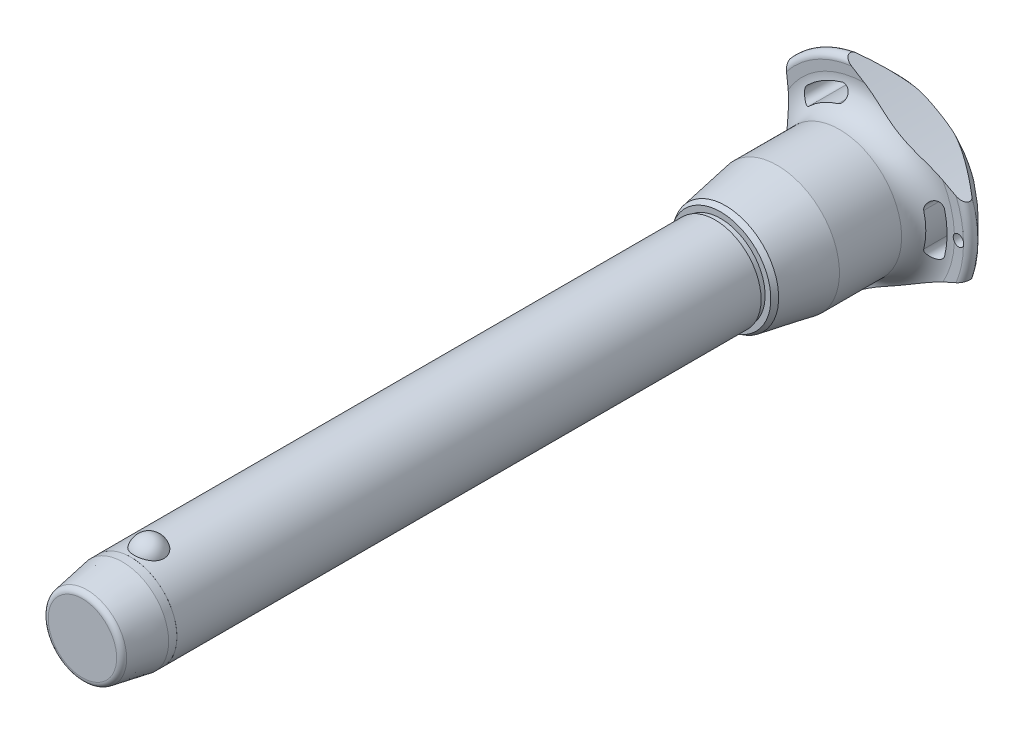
from build123d import *

# Parameters (mm, degrees)
SKETCH1_R           = 12.5
BOSS_EXTRUDE1_DEPTH = 150
SKETCH2_R           = 10
BOSS_EXTRUDE2_DEPTH = 50.7
BOSS_EXTRUDE3_START = 22
SKETCH1_2_R         = 12.5
BOSS_EXTRUDE3_DEPTH = 22
CHAMFER1_SIZE       = 11
CHAMFER1_SIZE2      = 1.939596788
FILLET1_R           = 1.5
SKETCH6_R           = 176.92625
CUT_EXTRUDE1_DEPTH  = 205.721493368
CIRPATTERN1_COUNT   = 3
SKETCH7_R           = 1.5
CUT_EXTRUDE2_DEPTH  = 205.647121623
SKETCH8_R           = 12.5
SKETCH8_R_2         = 12.49
CUT_EXTRUDE3_DEPTH  = 13.2


with BuildPart() as part:
    # Sketch1 → Boss-Extrude1 (new body)
    with BuildSketch(Plane.XY):
        Circle(SKETCH1_R)
    extrude(amount=-BOSS_EXTRUDE1_DEPTH)

    # Sketch2 → Boss-Extrude2 (add)
    with BuildSketch(Plane(origin=(0, 0, -150), x_dir=(-1, 0, 0), z_dir=(0, 0, -1))):
        with Locations(Location((0, 0, 0), (0, 0, 180))):
            Circle(SKETCH2_R)
    extrude(amount=BOSS_EXTRUDE2_DEPTH)

    # Sketch3 → Revolve1 (revolve)
    with BuildSketch(Plane(origin=(0, 0, 0), x_dir=(0, 0, -1), z_dir=(1, 0, 0))):
        with BuildLine():
            Line((-3.957271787, 15.4), (-3.957271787, 7.1))
            ThreePointArc((-3.957271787, 7.1), (0.192728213, 11.25), (-3.957271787, 15.4))
        make_face()
        with BuildLine():
            Line((-3.957271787, -7.1), (-3.957271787, -15.4))
            ThreePointArc((-3.957271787, -15.4), (0.192728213, -11.25), (-3.957271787, -7.1))
        make_face()
    revolve(axis=Axis((0, -7.1, 3.957271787), (0, 1, 0)))

    # Sketch1_2 → Boss-Extrude3 (add)
    with BuildSketch(Plane.XY.offset(BOSS_EXTRUDE3_START)):
        Circle(SKETCH1_2_R)
    extrude(amount=-BOSS_EXTRUDE3_DEPTH)

    # Chamfer1
    chamfer1_edges = [part.edges().sort_by_distance(p)[0] for p in [
        (-12.5, 0, 22),
    ]]
    chamfer1_side = [part.faces().sort_by_distance(p)[0] for p in [
        (-12.5, 0, -64),
    ]]
    chamfer(chamfer1_edges, length=CHAMFER1_SIZE, length2=CHAMFER1_SIZE2, reference=chamfer1_side[0])

    # Fillet1
    fillet1_edges = [part.edges().sort_by_distance(p)[0] for p in [
        (-10.560403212, 0, 22),
        (-10, 0, -200.7),
    ]]
    fillet(fillet1_edges, radius=FILLET1_R)

    # Sketch4 → Revolve2 (revolve)
    with BuildSketch(Plane(origin=(0, 0, 0), x_dir=(0, 0, -1), z_dir=(1, 0, 0)), mode=Mode.PRIVATE) as revolve2_sk:
        Polygon((150, 0), (150, 12.089202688), (151.5, 12.089202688), (151.5, 13.644437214), (152.846872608, 14.422054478), (166.9, 16.9), (183.8, 16.9), (183.8, 0), align=None)
    revolve(revolve2_sk.sketch.rotate(Axis((0, 0, -183.8), (0, 0, 1)), 90), axis=Axis((0, 0, -183.8), (0, 0, 1)))

    # Sketch5 → Revolve3 (revolve)
    with BuildSketch(Plane(origin=(0, 0, 0), x_dir=(0, 0, -1), z_dir=(1, 0, 0)), mode=Mode.PRIVATE) as revolve3_sk:
        with BuildLine():
            Line((190.790129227, 24.271609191), (190.652256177, 26.865060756))
            ThreePointArc((190.652256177, 26.865060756), (191.598671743, 28.411427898), (193.38137085, 28.08137085))
            Line((193.38137085, 28.08137085), (199.763226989, 21.69951471))
            ThreePointArc((199.763226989, 21.69951471), (200.7, 19.381044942), (199.683055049, 17.096604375))
            ThreePointArc((199.683055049, 17.096604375), (194.18864484, 9.321268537), (192.25, 0))
            Line((192.25, 0), (183.8, 0))
            Line((183.8, 0), (183.8, 16.9))
            ThreePointArc((183.8, 16.9), (188.879432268, 19.083427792), (190.790129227, 24.271609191))
        make_face()
    revolve(revolve3_sk.sketch.rotate(Axis((0, 0, -192.25), (0, 0, 1)), 90), axis=Axis((0, 0, -192.25), (0, 0, 1)))

    # Sketch6 → Cut-Extrude1 (cut, through all)
    with BuildSketch(Plane.XY):
        with Locations((-197.42625, 0)):
            Circle(SKETCH6_R)
        with BuildLine():
            ThreePointArc((21.757076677, -5.447614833), (22.428706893, 0), (21.757076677, 5.447614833))
            ThreePointArc((21.757076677, 5.447614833), (19.521745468, 6.787716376), (18.181643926, 4.552385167))
            ThreePointArc((18.181643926, 4.552385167), (18.742902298, 0), (18.181643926, -4.552385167))
            ThreePointArc((18.181643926, -4.552385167), (19.521745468, -6.787716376), (21.757076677, -5.447614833))
        make_face()
    cut_extrude1 = extrude(amount=-CUT_EXTRUDE1_DEPTH, mode=Mode.SUBTRACT)

    # CirPattern1: Cut-Extrude1 ×3 about axis
    cirpattern1_axis = Axis((0, 0, 0), (0, 0, 1))
    for i in range(1, CIRPATTERN1_COUNT):
        add(cut_extrude1.rotate(cirpattern1_axis, i * 360 / CIRPATTERN1_COUNT), mode=Mode.SUBTRACT)

    # Sketch7 → Cut-Extrude2 (cut, through all)
    with BuildSketch(Plane.XY):
        with Locations(Location((25.428706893, 0, 0), (0, 0, 17.230769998))):
            Circle(SKETCH7_R)
    extrude(amount=-CUT_EXTRUDE2_DEPTH, mode=Mode.SUBTRACT)

    # Sketch8 → Cut-Extrude3 (cut)
    with BuildSketch(Plane.XY.offset(22)):
        Circle(SKETCH8_R)
        Circle(SKETCH8_R_2, mode=Mode.SUBTRACT)
    extrude(amount=-CUT_EXTRUDE3_DEPTH, mode=Mode.SUBTRACT)


solid = part.part
